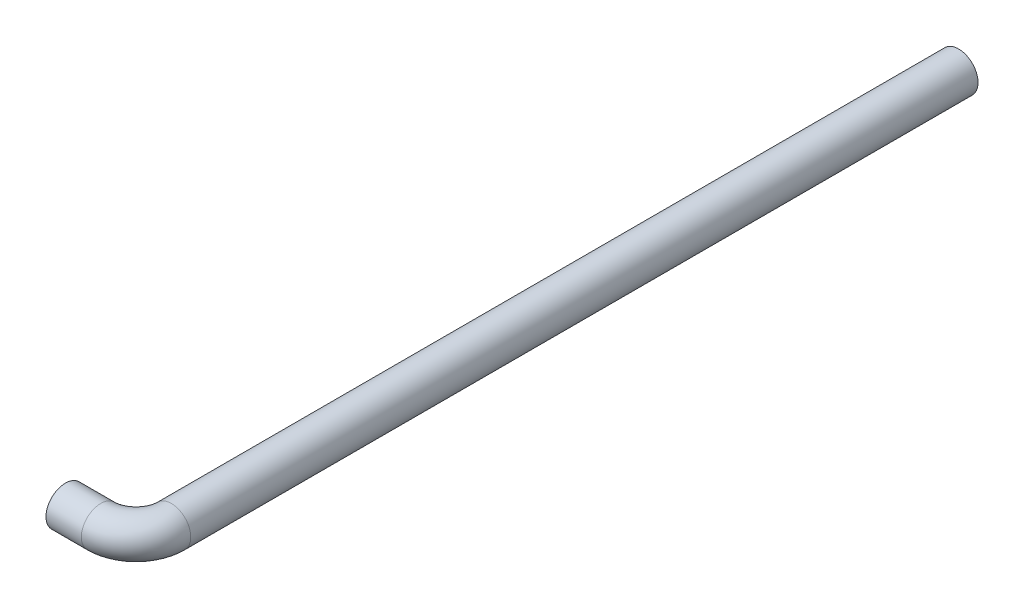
ISO-10303-21;
HEADER;
FILE_DESCRIPTION(('STEP AP214'),'2;1');
FILE_NAME('part.step','',(''),(''),'','','');
FILE_SCHEMA(('AUTOMOTIVE_DESIGN { 1 0 10303 214 1 1 1 1 }'));
ENDSEC;
DATA;
#1=APPLICATION_CONTEXT('core data for automotive mechanical design processes');
#2=APPLICATION_PROTOCOL_DEFINITION('international standard','automotive_design',2000,#1);
#3=PRODUCT_CONTEXT('',#1,'mechanical');
#4=PRODUCT('Part','Part','',(#3));
#5=PRODUCT_RELATED_PRODUCT_CATEGORY('part','',(#4));
#6=PRODUCT_DEFINITION_FORMATION('','',#4);
#7=PRODUCT_DEFINITION_CONTEXT('part definition',#1,'design');
#8=PRODUCT_DEFINITION('design','',#6,#7);
#9=PRODUCT_DEFINITION_SHAPE('','',#8);
#10=(LENGTH_UNIT() NAMED_UNIT(*) SI_UNIT(.MILLI.,.METRE.));
#11=(NAMED_UNIT(*) PLANE_ANGLE_UNIT() SI_UNIT($,.RADIAN.));
#12=(NAMED_UNIT(*) SI_UNIT($,.STERADIAN.) SOLID_ANGLE_UNIT());
#13=UNCERTAINTY_MEASURE_WITH_UNIT(LENGTH_MEASURE(1.E-05),#10,'distance_accuracy_value','');
#14=(GEOMETRIC_REPRESENTATION_CONTEXT(3) GLOBAL_UNCERTAINTY_ASSIGNED_CONTEXT((#13)) GLOBAL_UNIT_ASSIGNED_CONTEXT((#10,
#11,#12)) REPRESENTATION_CONTEXT('',''));
#15=CARTESIAN_POINT('',(0.,0.,0.));
#16=DIRECTION('',(0.,0.,1.));
#17=DIRECTION('',(1.,0.,0.));
#18=AXIS2_PLACEMENT_3D('',#15,#16,#17);
#19=CARTESIAN_POINT('',(6.,0.,-3.));
#20=DIRECTION('',(0.,0.,-1.));
#21=DIRECTION('',(-1.,0.,0.));
#22=AXIS2_PLACEMENT_3D('',#19,#20,#21);
#23=CYLINDRICAL_SURFACE('',#22,1.65);
#24=CARTESIAN_POINT('',(6.,0.,-3.));
#25=DIRECTION('',(0.,0.,-1.));
#26=DIRECTION('',(-1.,0.,0.));
#27=AXIS2_PLACEMENT_3D('',#24,#25,#26);
#28=CIRCLE('',#27,1.65);
#29=CARTESIAN_POINT('',(7.65,0.,-3.));
#30=VERTEX_POINT('',#29);
#31=EDGE_CURVE('E37',#30,#30,#28,.T.);
#32=ORIENTED_EDGE('',*,*,#31,.T.);
#33=EDGE_LOOP('',(#32));
#34=FACE_BOUND('',#33,.T.);
#35=CARTESIAN_POINT('',(6.,0.,-69.9));
#36=DIRECTION('',(0.,0.,-1.));
#37=DIRECTION('',(-1.,0.,0.));
#38=AXIS2_PLACEMENT_3D('',#35,#36,#37);
#39=CIRCLE('',#38,1.65);
#40=CARTESIAN_POINT('',(4.35,0.,-69.9));
#41=VERTEX_POINT('',#40);
#42=EDGE_CURVE('E10',#41,#41,#39,.T.);
#43=ORIENTED_EDGE('',*,*,#42,.F.);
#44=EDGE_LOOP('',(#43));
#45=FACE_BOUND('',#44,.T.);
#46=ADVANCED_FACE('F31',(#34,#45),#23,.T.);
#47=CARTESIAN_POINT('',(3.,0.,-3.));
#48=DIRECTION('',(0.,1.,0.));
#49=DIRECTION('',(0.,0.,1.));
#50=AXIS2_PLACEMENT_3D('',#47,#48,#49);
#51=TOROIDAL_SURFACE('',#50,3.,1.65);
#52=CARTESIAN_POINT('',(3.,0.,0.));
#53=DIRECTION('',(1.,0.,0.));
#54=DIRECTION('',(0.,0.,-1.));
#55=AXIS2_PLACEMENT_3D('',#52,#53,#54);
#56=CIRCLE('',#55,1.65);
#57=CARTESIAN_POINT('',(3.,0.,1.65));
#58=VERTEX_POINT('',#57);
#59=EDGE_CURVE('E41',#58,#58,#56,.T.);
#60=CARTESIAN_POINT('',(3.,0.,-3.));
#61=DIRECTION('',(0.,1.,0.));
#62=DIRECTION('',(0.,0.,1.));
#63=AXIS2_PLACEMENT_3D('',#60,#61,#62);
#64=CIRCLE('',#63,4.65);
#65=EDGE_CURVE('',#58,#30,#64,.T.);
#66=ORIENTED_EDGE('',*,*,#59,.T.);
#67=ORIENTED_EDGE('',*,*,#31,.F.);
#68=ORIENTED_EDGE('',*,*,#65,.T.);
#69=ORIENTED_EDGE('',*,*,#65,.F.);
#70=EDGE_LOOP('',(#66,#68,#67,#69));
#71=FACE_BOUND('',#70,.T.);
#72=ADVANCED_FACE('F63',(#71),#51,.T.);
#73=CARTESIAN_POINT('',(3.,0.,0.));
#74=DIRECTION('',(-1.,0.,0.));
#75=DIRECTION('',(0.,0.,1.));
#76=AXIS2_PLACEMENT_3D('',#73,#74,#75);
#77=CYLINDRICAL_SURFACE('',#76,1.65);
#78=ORIENTED_EDGE('',*,*,#59,.F.);
#79=EDGE_LOOP('',(#78));
#80=FACE_BOUND('',#79,.T.);
#81=CARTESIAN_POINT('',(0.,0.,0.));
#82=DIRECTION('',(1.,0.,0.));
#83=DIRECTION('',(0.,0.,-1.));
#84=AXIS2_PLACEMENT_3D('',#81,#82,#83);
#85=CIRCLE('',#84,1.65);
#86=CARTESIAN_POINT('',(0.,0.,-1.65));
#87=VERTEX_POINT('',#86);
#88=EDGE_CURVE('E45',#87,#87,#85,.T.);
#89=ORIENTED_EDGE('',*,*,#88,.T.);
#90=EDGE_LOOP('',(#89));
#91=FACE_BOUND('',#90,.T.);
#92=ADVANCED_FACE('F51',(#80,#91),#77,.T.);
#93=CARTESIAN_POINT('',(6.,0.,-69.9));
#94=DIRECTION('',(0.,0.,-1.));
#95=DIRECTION('',(-1.,0.,0.));
#96=AXIS2_PLACEMENT_3D('',#93,#94,#95);
#97=PLANE('',#96);
#98=ORIENTED_EDGE('',*,*,#42,.T.);
#99=EDGE_LOOP('',(#98));
#100=FACE_BOUND('',#99,.T.);
#101=ADVANCED_FACE('F55',(#100),#97,.T.);
#102=CARTESIAN_POINT('',(0.,0.,0.));
#103=DIRECTION('',(1.,0.,0.));
#104=DIRECTION('',(0.,0.,-1.));
#105=AXIS2_PLACEMENT_3D('',#102,#103,#104);
#106=PLANE('',#105);
#107=ORIENTED_EDGE('',*,*,#88,.F.);
#108=EDGE_LOOP('',(#107));
#109=FACE_BOUND('',#108,.T.);
#110=ADVANCED_FACE('F53',(#109),#106,.F.);
#111=CLOSED_SHELL('',(#46,#72,#92,#101,#110));
#112=MANIFOLD_SOLID_BREP('B2',#111);
#113=ADVANCED_BREP_SHAPE_REPRESENTATION('',(#18,#112),#14);
#114=SHAPE_DEFINITION_REPRESENTATION(#9,#113);
ENDSEC;
END-ISO-10303-21;
